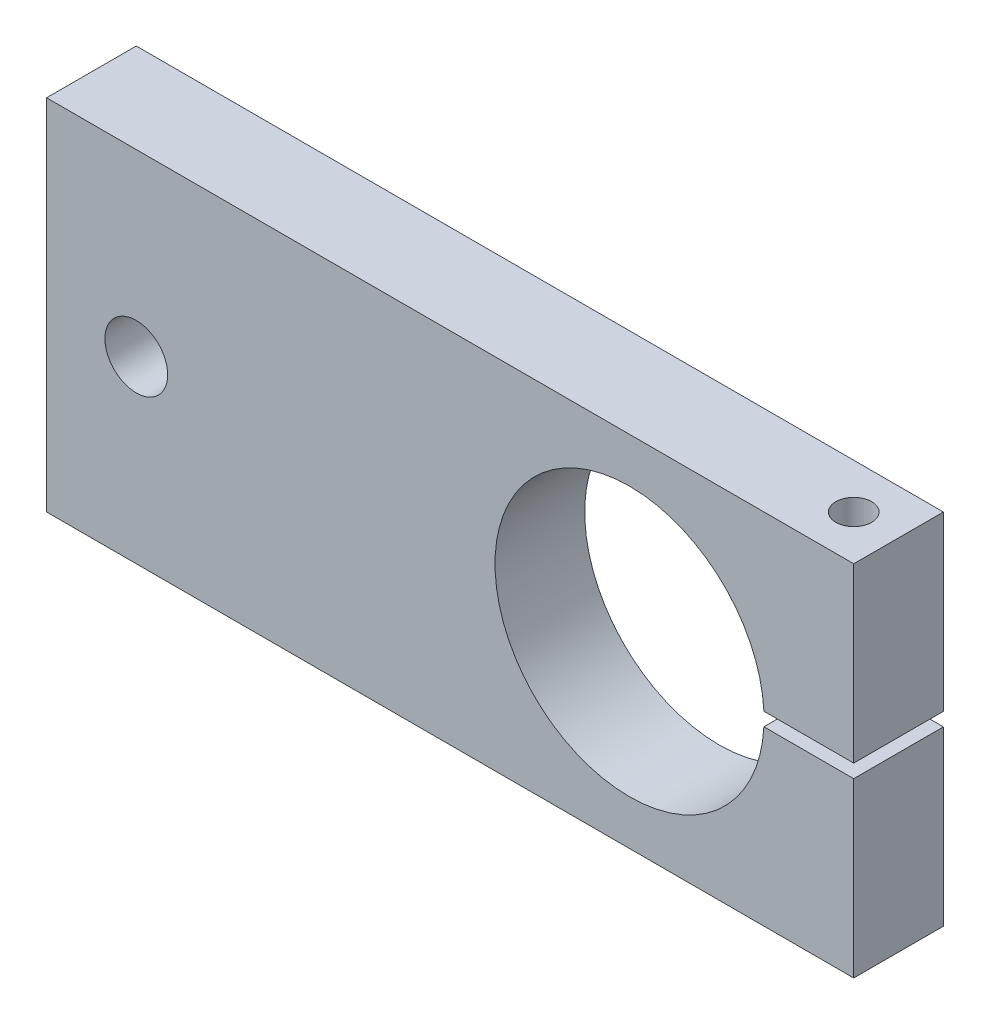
ISO-10303-21;
HEADER;
FILE_DESCRIPTION(('STEP AP214'),'2;1');
FILE_NAME('part.step','',(''),(''),'','','');
FILE_SCHEMA(('AUTOMOTIVE_DESIGN { 1 0 10303 214 1 1 1 1 }'));
ENDSEC;
DATA;
#1=APPLICATION_CONTEXT('core data for automotive mechanical design processes');
#2=APPLICATION_PROTOCOL_DEFINITION('international standard','automotive_design',2000,#1);
#3=PRODUCT_CONTEXT('',#1,'mechanical');
#4=PRODUCT('Part','Part','',(#3));
#5=PRODUCT_RELATED_PRODUCT_CATEGORY('part','',(#4));
#6=PRODUCT_DEFINITION_FORMATION('','',#4);
#7=PRODUCT_DEFINITION_CONTEXT('part definition',#1,'design');
#8=PRODUCT_DEFINITION('design','',#6,#7);
#9=PRODUCT_DEFINITION_SHAPE('','',#8);
#10=(LENGTH_UNIT() NAMED_UNIT(*) SI_UNIT(.MILLI.,.METRE.));
#11=(NAMED_UNIT(*) PLANE_ANGLE_UNIT() SI_UNIT($,.RADIAN.));
#12=(NAMED_UNIT(*) SI_UNIT($,.STERADIAN.) SOLID_ANGLE_UNIT());
#13=UNCERTAINTY_MEASURE_WITH_UNIT(LENGTH_MEASURE(1.E-05),#10,'distance_accuracy_value','');
#14=(GEOMETRIC_REPRESENTATION_CONTEXT(3) GLOBAL_UNCERTAINTY_ASSIGNED_CONTEXT((#13)) GLOBAL_UNIT_ASSIGNED_CONTEXT((#10,
#11,#12)) REPRESENTATION_CONTEXT('',''));
#15=CARTESIAN_POINT('',(0.,0.,0.));
#16=DIRECTION('',(0.,0.,1.));
#17=DIRECTION('',(1.,0.,0.));
#18=AXIS2_PLACEMENT_3D('',#15,#16,#17);
#19=CARTESIAN_POINT('',(50.,-40.,20.));
#20=DIRECTION('',(-1.,0.,0.));
#21=DIRECTION('',(0.,0.,1.));
#22=AXIS2_PLACEMENT_3D('',#19,#20,#21);
#23=PLANE('',#22);
#24=DIRECTION('',(0.,1.,0.));
#25=VECTOR('',#24,1.);
#26=CARTESIAN_POINT('',(50.,-40.,0.));
#27=LINE('',#26,#25);
#28=CARTESIAN_POINT('',(50.,-40.,0.));
#29=VERTEX_POINT('',#28);
#30=CARTESIAN_POINT('',(50.,-1.5,0.));
#31=VERTEX_POINT('',#30);
#32=EDGE_CURVE('E147',#29,#31,#27,.T.);
#33=ORIENTED_EDGE('',*,*,#32,.T.);
#34=DIRECTION('',(0.,0.,1.));
#35=VECTOR('',#34,1.);
#36=CARTESIAN_POINT('',(50.,-1.5,20.));
#37=LINE('',#36,#35);
#38=CARTESIAN_POINT('',(50.,-1.5,20.));
#39=VERTEX_POINT('',#38);
#40=EDGE_CURVE('E174',#31,#39,#37,.T.);
#41=ORIENTED_EDGE('',*,*,#40,.T.);
#42=DIRECTION('',(0.,1.,0.));
#43=VECTOR('',#42,1.);
#44=CARTESIAN_POINT('',(50.,-40.,20.));
#45=LINE('',#44,#43);
#46=CARTESIAN_POINT('',(50.,-40.,20.));
#47=VERTEX_POINT('',#46);
#48=EDGE_CURVE('E137',#47,#39,#45,.T.);
#49=ORIENTED_EDGE('',*,*,#48,.F.);
#50=DIRECTION('',(0.,0.,-1.));
#51=VECTOR('',#50,1.);
#52=CARTESIAN_POINT('',(50.,-40.,20.));
#53=LINE('',#52,#51);
#54=EDGE_CURVE('E11',#47,#29,#53,.T.);
#55=ORIENTED_EDGE('',*,*,#54,.T.);
#56=EDGE_LOOP('',(#33,#41,#49,#55));
#57=FACE_BOUND('',#56,.T.);
#58=ADVANCED_FACE('F36',(#57),#23,.F.);
#59=CARTESIAN_POINT('',(0.,0.,20.));
#60=DIRECTION('',(0.,0.,1.));
#61=DIRECTION('',(1.,0.,0.));
#62=AXIS2_PLACEMENT_3D('',#59,#60,#61);
#63=PLANE('',#62);
#64=DIRECTION('',(1.,0.,0.));
#65=VECTOR('',#64,1.);
#66=CARTESIAN_POINT('',(29.9624765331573,-1.5,20.));
#67=LINE('',#66,#65);
#68=CARTESIAN_POINT('',(29.9624765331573,-1.5,20.));
#69=VERTEX_POINT('',#68);
#70=EDGE_CURVE('E119',#69,#39,#67,.T.);
#71=ORIENTED_EDGE('',*,*,#70,.F.);
#72=CARTESIAN_POINT('',(0.,0.,20.));
#73=DIRECTION('',(0.,0.,1.));
#74=DIRECTION('',(1.,0.,0.));
#75=AXIS2_PLACEMENT_3D('',#72,#73,#74);
#76=CIRCLE('',#75,30.);
#77=CARTESIAN_POINT('',(29.9624765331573,1.5,20.));
#78=VERTEX_POINT('',#77);
#79=EDGE_CURVE('E122',#78,#69,#76,.T.);
#80=ORIENTED_EDGE('',*,*,#79,.F.);
#81=DIRECTION('',(-1.,0.,0.));
#82=VECTOR('',#81,1.);
#83=CARTESIAN_POINT('',(29.9624765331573,1.5,20.));
#84=LINE('',#83,#82);
#85=CARTESIAN_POINT('',(50.,1.5,20.));
#86=VERTEX_POINT('',#85);
#87=EDGE_CURVE('E61',#86,#78,#84,.T.);
#88=ORIENTED_EDGE('',*,*,#87,.F.);
#89=CARTESIAN_POINT('',(50.,40.,20.));
#90=VERTEX_POINT('',#89);
#91=EDGE_CURVE('E135',#86,#90,#45,.T.);
#92=ORIENTED_EDGE('',*,*,#91,.T.);
#93=DIRECTION('',(-1.,0.,0.));
#94=VECTOR('',#93,1.);
#95=CARTESIAN_POINT('',(50.,40.,20.));
#96=LINE('',#95,#94);
#97=CARTESIAN_POINT('',(-130.,40.,20.));
#98=VERTEX_POINT('',#97);
#99=EDGE_CURVE('E140',#90,#98,#96,.T.);
#100=ORIENTED_EDGE('',*,*,#99,.T.);
#101=DIRECTION('',(0.,-1.,0.));
#102=VECTOR('',#101,1.);
#103=CARTESIAN_POINT('',(-130.,40.,20.));
#104=LINE('',#103,#102);
#105=CARTESIAN_POINT('',(-130.,-40.,20.));
#106=VERTEX_POINT('',#105);
#107=EDGE_CURVE('E142',#98,#106,#104,.T.);
#108=ORIENTED_EDGE('',*,*,#107,.T.);
#109=DIRECTION('',(1.,0.,0.));
#110=VECTOR('',#109,1.);
#111=CARTESIAN_POINT('',(-130.,-40.,20.));
#112=LINE('',#111,#110);
#113=EDGE_CURVE('E132',#106,#47,#112,.T.);
#114=ORIENTED_EDGE('',*,*,#113,.T.);
#115=ORIENTED_EDGE('',*,*,#48,.T.);
#116=EDGE_LOOP('',(#71,#80,#88,#92,#100,#108,#114,#115));
#117=FACE_BOUND('',#116,.T.);
#118=CARTESIAN_POINT('',(-110.,0.,20.));
#119=DIRECTION('',(0.,0.,1.));
#120=DIRECTION('',(1.,0.,0.));
#121=AXIS2_PLACEMENT_3D('',#118,#119,#120);
#122=CIRCLE('',#121,7.);
#123=CARTESIAN_POINT('',(-103.,0.,20.));
#124=VERTEX_POINT('',#123);
#125=EDGE_CURVE('E123',#124,#124,#122,.T.);
#126=ORIENTED_EDGE('',*,*,#125,.F.);
#127=EDGE_LOOP('',(#126));
#128=FACE_BOUND('',#127,.T.);
#129=ADVANCED_FACE('F203',(#117,#128),#63,.T.);
#130=CARTESIAN_POINT('',(0.,0.,0.));
#131=DIRECTION('',(0.,0.,1.));
#132=DIRECTION('',(1.,0.,0.));
#133=AXIS2_PLACEMENT_3D('',#130,#131,#132);
#134=PLANE('',#133);
#135=CARTESIAN_POINT('',(0.,0.,0.));
#136=DIRECTION('',(0.,0.,1.));
#137=DIRECTION('',(1.,0.,0.));
#138=AXIS2_PLACEMENT_3D('',#135,#136,#137);
#139=CIRCLE('',#138,30.);
#140=CARTESIAN_POINT('',(29.9624765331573,1.50000000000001,0.));
#141=VERTEX_POINT('',#140);
#142=CARTESIAN_POINT('',(29.9624765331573,-1.5,0.));
#143=VERTEX_POINT('',#142);
#144=EDGE_CURVE('E116',#141,#143,#139,.T.);
#145=ORIENTED_EDGE('',*,*,#144,.T.);
#146=DIRECTION('',(1.,0.,0.));
#147=VECTOR('',#146,1.);
#148=CARTESIAN_POINT('',(29.9624765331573,-1.5,0.));
#149=LINE('',#148,#147);
#150=EDGE_CURVE('E53',#143,#31,#149,.T.);
#151=ORIENTED_EDGE('',*,*,#150,.T.);
#152=ORIENTED_EDGE('',*,*,#32,.F.);
#153=DIRECTION('',(1.,0.,0.));
#154=VECTOR('',#153,1.);
#155=CARTESIAN_POINT('',(-130.,-40.,0.));
#156=LINE('',#155,#154);
#157=CARTESIAN_POINT('',(-130.,-40.,0.));
#158=VERTEX_POINT('',#157);
#159=EDGE_CURVE('E125',#158,#29,#156,.T.);
#160=ORIENTED_EDGE('',*,*,#159,.F.);
#161=DIRECTION('',(0.,-1.,0.));
#162=VECTOR('',#161,1.);
#163=CARTESIAN_POINT('',(-130.,40.,0.));
#164=LINE('',#163,#162);
#165=CARTESIAN_POINT('',(-130.,40.,0.));
#166=VERTEX_POINT('',#165);
#167=EDGE_CURVE('E136',#166,#158,#164,.T.);
#168=ORIENTED_EDGE('',*,*,#167,.F.);
#169=DIRECTION('',(-1.,0.,0.));
#170=VECTOR('',#169,1.);
#171=CARTESIAN_POINT('',(50.,40.,0.));
#172=LINE('',#171,#170);
#173=CARTESIAN_POINT('',(50.,40.,0.));
#174=VERTEX_POINT('',#173);
#175=EDGE_CURVE('E150',#174,#166,#172,.T.);
#176=ORIENTED_EDGE('',*,*,#175,.F.);
#177=CARTESIAN_POINT('',(50.,1.5,0.));
#178=VERTEX_POINT('',#177);
#179=EDGE_CURVE('E118',#178,#174,#27,.T.);
#180=ORIENTED_EDGE('',*,*,#179,.F.);
#181=DIRECTION('',(-1.,0.,0.));
#182=VECTOR('',#181,1.);
#183=CARTESIAN_POINT('',(29.9624765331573,1.5,0.));
#184=LINE('',#183,#182);
#185=EDGE_CURVE('E103',#178,#141,#184,.T.);
#186=ORIENTED_EDGE('',*,*,#185,.T.);
#187=EDGE_LOOP('',(#145,#151,#152,#160,#168,#176,#180,#186));
#188=FACE_BOUND('',#187,.T.);
#189=CARTESIAN_POINT('',(-110.,0.,0.));
#190=DIRECTION('',(0.,0.,1.));
#191=DIRECTION('',(1.,0.,0.));
#192=AXIS2_PLACEMENT_3D('',#189,#190,#191);
#193=CIRCLE('',#192,7.);
#194=CARTESIAN_POINT('',(-103.,0.,0.));
#195=VERTEX_POINT('',#194);
#196=EDGE_CURVE('E128',#195,#195,#193,.T.);
#197=ORIENTED_EDGE('',*,*,#196,.T.);
#198=EDGE_LOOP('',(#197));
#199=FACE_BOUND('',#198,.T.);
#200=ADVANCED_FACE('F114',(#188,#199),#134,.F.);
#201=CARTESIAN_POINT('',(-130.,-40.,20.));
#202=DIRECTION('',(0.,1.,0.));
#203=DIRECTION('',(0.,0.,1.));
#204=AXIS2_PLACEMENT_3D('',#201,#202,#203);
#205=PLANE('',#204);
#206=CARTESIAN_POINT('',(40.,-40.,10.));
#207=DIRECTION('',(0.,-1.,0.));
#208=DIRECTION('',(0.,0.,-1.));
#209=AXIS2_PLACEMENT_3D('',#206,#207,#208);
#210=CIRCLE('',#209,7.);
#211=CARTESIAN_POINT('',(40.,-40.,3.));
#212=VERTEX_POINT('',#211);
#213=EDGE_CURVE('E180',#212,#212,#210,.T.);
#214=ORIENTED_EDGE('',*,*,#213,.F.);
#215=EDGE_LOOP('',(#214));
#216=FACE_BOUND('',#215,.T.);
#217=ORIENTED_EDGE('',*,*,#159,.T.);
#218=ORIENTED_EDGE('',*,*,#54,.F.);
#219=ORIENTED_EDGE('',*,*,#113,.F.);
#220=DIRECTION('',(0.,0.,-1.));
#221=VECTOR('',#220,1.);
#222=CARTESIAN_POINT('',(-130.,-40.,20.));
#223=LINE('',#222,#221);
#224=EDGE_CURVE('E144',#106,#158,#223,.T.);
#225=ORIENTED_EDGE('',*,*,#224,.T.);
#226=EDGE_LOOP('',(#217,#218,#219,#225));
#227=FACE_BOUND('',#226,.T.);
#228=ADVANCED_FACE('F38',(#216,#227),#205,.F.);
#229=ORIENTED_EDGE('',*,*,#91,.F.);
#230=DIRECTION('',(0.,0.,-1.));
#231=VECTOR('',#230,1.);
#232=CARTESIAN_POINT('',(50.,1.49999999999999,20.));
#233=LINE('',#232,#231);
#234=EDGE_CURVE('E165',#86,#178,#233,.T.);
#235=ORIENTED_EDGE('',*,*,#234,.T.);
#236=ORIENTED_EDGE('',*,*,#179,.T.);
#237=DIRECTION('',(0.,0.,-1.));
#238=VECTOR('',#237,1.);
#239=CARTESIAN_POINT('',(50.,40.,20.));
#240=LINE('',#239,#238);
#241=EDGE_CURVE('E45',#90,#174,#240,.T.);
#242=ORIENTED_EDGE('',*,*,#241,.F.);
#243=EDGE_LOOP('',(#229,#235,#236,#242));
#244=FACE_BOUND('',#243,.T.);
#245=ADVANCED_FACE('F205',(#244),#23,.F.);
#246=CARTESIAN_POINT('',(50.,40.,20.));
#247=DIRECTION('',(0.,-1.,0.));
#248=DIRECTION('',(1.,0.,0.));
#249=AXIS2_PLACEMENT_3D('',#246,#247,#248);
#250=PLANE('',#249);
#251=CARTESIAN_POINT('',(40.,40.,10.));
#252=DIRECTION('',(0.,1.,0.));
#253=DIRECTION('',(-1.,0.,0.));
#254=AXIS2_PLACEMENT_3D('',#251,#252,#253);
#255=CIRCLE('',#254,4.00000000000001);
#256=CARTESIAN_POINT('',(36.,40.,10.));
#257=VERTEX_POINT('',#256);
#258=EDGE_CURVE('E177',#257,#257,#255,.T.);
#259=ORIENTED_EDGE('',*,*,#258,.F.);
#260=EDGE_LOOP('',(#259));
#261=FACE_BOUND('',#260,.T.);
#262=ORIENTED_EDGE('',*,*,#175,.T.);
#263=DIRECTION('',(0.,0.,-1.));
#264=VECTOR('',#263,1.);
#265=CARTESIAN_POINT('',(-130.,40.,20.));
#266=LINE('',#265,#264);
#267=EDGE_CURVE('E155',#98,#166,#266,.T.);
#268=ORIENTED_EDGE('',*,*,#267,.F.);
#269=ORIENTED_EDGE('',*,*,#99,.F.);
#270=ORIENTED_EDGE('',*,*,#241,.T.);
#271=EDGE_LOOP('',(#262,#268,#269,#270));
#272=FACE_BOUND('',#271,.T.);
#273=ADVANCED_FACE('F213',(#261,#272),#250,.F.);
#274=CARTESIAN_POINT('',(-130.,40.,20.));
#275=DIRECTION('',(1.,0.,0.));
#276=DIRECTION('',(0.,1.,0.));
#277=AXIS2_PLACEMENT_3D('',#274,#275,#276);
#278=PLANE('',#277);
#279=ORIENTED_EDGE('',*,*,#167,.T.);
#280=ORIENTED_EDGE('',*,*,#224,.F.);
#281=ORIENTED_EDGE('',*,*,#107,.F.);
#282=ORIENTED_EDGE('',*,*,#267,.T.);
#283=EDGE_LOOP('',(#279,#280,#281,#282));
#284=FACE_BOUND('',#283,.T.);
#285=ADVANCED_FACE('F199',(#284),#278,.F.);
#286=CARTESIAN_POINT('',(0.,0.,20.));
#287=DIRECTION('',(0.,0.,-1.));
#288=DIRECTION('',(-1.,0.,0.));
#289=AXIS2_PLACEMENT_3D('',#286,#287,#288);
#290=CYLINDRICAL_SURFACE('',#289,30.);
#291=DIRECTION('',(0.,0.,1.));
#292=VECTOR('',#291,1.);
#293=CARTESIAN_POINT('',(29.9624765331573,-1.5,0.));
#294=LINE('',#293,#292);
#295=EDGE_CURVE('E109',#143,#69,#294,.T.);
#296=ORIENTED_EDGE('',*,*,#295,.F.);
#297=ORIENTED_EDGE('',*,*,#144,.F.);
#298=DIRECTION('',(0.,0.,1.));
#299=VECTOR('',#298,1.);
#300=CARTESIAN_POINT('',(29.9624765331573,1.50000000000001,0.));
#301=LINE('',#300,#299);
#302=EDGE_CURVE('E100',#141,#78,#301,.T.);
#303=ORIENTED_EDGE('',*,*,#302,.T.);
#304=ORIENTED_EDGE('',*,*,#79,.T.);
#305=EDGE_LOOP('',(#296,#297,#303,#304));
#306=FACE_BOUND('',#305,.T.);
#307=ADVANCED_FACE('F121',(#306),#290,.F.);
#308=CARTESIAN_POINT('',(-110.,0.,20.));
#309=DIRECTION('',(0.,0.,-1.));
#310=DIRECTION('',(-1.,0.,0.));
#311=AXIS2_PLACEMENT_3D('',#308,#309,#310);
#312=CYLINDRICAL_SURFACE('',#311,7.);
#313=ORIENTED_EDGE('',*,*,#125,.T.);
#314=EDGE_LOOP('',(#313));
#315=FACE_BOUND('',#314,.T.);
#316=ORIENTED_EDGE('',*,*,#196,.F.);
#317=EDGE_LOOP('',(#316));
#318=FACE_BOUND('',#317,.T.);
#319=ADVANCED_FACE('F187',(#315,#318),#312,.F.);
#320=CARTESIAN_POINT('',(40.,-30.,10.));
#321=DIRECTION('',(0.,-1.,0.));
#322=DIRECTION('',(0.,0.,-1.));
#323=AXIS2_PLACEMENT_3D('',#320,#321,#322);
#324=PLANE('',#323);
#325=CARTESIAN_POINT('',(40.,-30.,10.));
#326=DIRECTION('',(0.,-1.,0.));
#327=DIRECTION('',(0.,0.,-1.));
#328=AXIS2_PLACEMENT_3D('',#325,#326,#327);
#329=CIRCLE('',#328,7.);
#330=CARTESIAN_POINT('',(40.,-30.,3.));
#331=VERTEX_POINT('',#330);
#332=EDGE_CURVE('E162',#331,#331,#329,.T.);
#333=ORIENTED_EDGE('',*,*,#332,.T.);
#334=EDGE_LOOP('',(#333));
#335=FACE_BOUND('',#334,.T.);
#336=CARTESIAN_POINT('',(40.,-30.,10.));
#337=DIRECTION('',(0.,-1.,0.));
#338=DIRECTION('',(0.,0.,-1.));
#339=AXIS2_PLACEMENT_3D('',#336,#337,#338);
#340=CIRCLE('',#339,4.5);
#341=CARTESIAN_POINT('',(40.,-30.,5.5));
#342=VERTEX_POINT('',#341);
#343=EDGE_CURVE('E160',#342,#342,#340,.F.);
#344=ORIENTED_EDGE('',*,*,#343,.T.);
#345=EDGE_LOOP('',(#344));
#346=FACE_BOUND('',#345,.T.);
#347=ADVANCED_FACE('F189',(#335,#346),#324,.T.);
#348=CARTESIAN_POINT('',(40.,-30.,10.));
#349=DIRECTION('',(0.,-1.,0.));
#350=DIRECTION('',(0.,0.,-1.));
#351=AXIS2_PLACEMENT_3D('',#348,#349,#350);
#352=CYLINDRICAL_SURFACE('',#351,7.);
#353=ORIENTED_EDGE('',*,*,#332,.F.);
#354=EDGE_LOOP('',(#353));
#355=FACE_BOUND('',#354,.T.);
#356=ORIENTED_EDGE('',*,*,#213,.T.);
#357=EDGE_LOOP('',(#356));
#358=FACE_BOUND('',#357,.T.);
#359=ADVANCED_FACE('F196',(#355,#358),#352,.F.);
#360=CARTESIAN_POINT('',(40.,0.,10.));
#361=DIRECTION('',(0.,-1.,0.));
#362=DIRECTION('',(0.,0.,-1.));
#363=AXIS2_PLACEMENT_3D('',#360,#361,#362);
#364=CYLINDRICAL_SURFACE('',#363,4.5);
#365=CARTESIAN_POINT('',(40.,-1.5,10.));
#366=DIRECTION('',(0.,-1.,0.));
#367=DIRECTION('',(0.,0.,-1.));
#368=AXIS2_PLACEMENT_3D('',#365,#366,#367);
#369=CIRCLE('',#368,4.5);
#370=CARTESIAN_POINT('',(40.,-1.5,5.5));
#371=VERTEX_POINT('',#370);
#372=EDGE_CURVE('E40',#371,#371,#369,.F.);
#373=ORIENTED_EDGE('',*,*,#372,.T.);
#374=EDGE_LOOP('',(#373));
#375=FACE_BOUND('',#374,.T.);
#376=ORIENTED_EDGE('',*,*,#343,.F.);
#377=EDGE_LOOP('',(#376));
#378=FACE_BOUND('',#377,.T.);
#379=ADVANCED_FACE('F249',(#375,#378),#364,.F.);
#380=CARTESIAN_POINT('',(40.,0.,10.));
#381=DIRECTION('',(0.,1.,0.));
#382=DIRECTION('',(-1.,0.,0.));
#383=AXIS2_PLACEMENT_3D('',#380,#381,#382);
#384=CYLINDRICAL_SURFACE('',#383,4.00000000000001);
#385=CARTESIAN_POINT('',(40.,1.5,10.));
#386=DIRECTION('',(0.,1.,0.));
#387=DIRECTION('',(0.,0.,1.));
#388=AXIS2_PLACEMENT_3D('',#385,#386,#387);
#389=CIRCLE('',#388,4.00000000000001);
#390=CARTESIAN_POINT('',(40.,1.5,14.));
#391=VERTEX_POINT('',#390);
#392=EDGE_CURVE('E163',#391,#391,#389,.F.);
#393=ORIENTED_EDGE('',*,*,#392,.T.);
#394=EDGE_LOOP('',(#393));
#395=FACE_BOUND('',#394,.T.);
#396=ORIENTED_EDGE('',*,*,#258,.T.);
#397=EDGE_LOOP('',(#396));
#398=FACE_BOUND('',#397,.T.);
#399=ADVANCED_FACE('F243',(#395,#398),#384,.F.);
#400=CARTESIAN_POINT('',(29.9624765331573,1.5,0.));
#401=DIRECTION('',(0.,1.,0.));
#402=DIRECTION('',(0.,0.,1.));
#403=AXIS2_PLACEMENT_3D('',#400,#401,#402);
#404=PLANE('',#403);
#405=ORIENTED_EDGE('',*,*,#392,.F.);
#406=EDGE_LOOP('',(#405));
#407=FACE_BOUND('',#406,.T.);
#408=ORIENTED_EDGE('',*,*,#87,.T.);
#409=ORIENTED_EDGE('',*,*,#302,.F.);
#410=ORIENTED_EDGE('',*,*,#185,.F.);
#411=ORIENTED_EDGE('',*,*,#234,.F.);
#412=EDGE_LOOP('',(#408,#409,#410,#411));
#413=FACE_BOUND('',#412,.T.);
#414=ADVANCED_FACE('F102',(#407,#413),#404,.F.);
#415=CARTESIAN_POINT('',(29.9624765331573,-1.5,0.));
#416=DIRECTION('',(0.,-1.,0.));
#417=DIRECTION('',(0.,0.,-1.));
#418=AXIS2_PLACEMENT_3D('',#415,#416,#417);
#419=PLANE('',#418);
#420=ORIENTED_EDGE('',*,*,#372,.F.);
#421=EDGE_LOOP('',(#420));
#422=FACE_BOUND('',#421,.T.);
#423=ORIENTED_EDGE('',*,*,#150,.F.);
#424=ORIENTED_EDGE('',*,*,#295,.T.);
#425=ORIENTED_EDGE('',*,*,#70,.T.);
#426=ORIENTED_EDGE('',*,*,#40,.F.);
#427=EDGE_LOOP('',(#423,#424,#425,#426));
#428=FACE_BOUND('',#427,.T.);
#429=ADVANCED_FACE('F236',(#422,#428),#419,.F.);
#430=CLOSED_SHELL('',(#58,#129,#200,#228,#245,#273,#285,#307,#319,#347,#359,#379,#399,#414,#429));
#431=MANIFOLD_SOLID_BREP('B2',#430);
#432=ADVANCED_BREP_SHAPE_REPRESENTATION('',(#18,#431),#14);
#433=SHAPE_DEFINITION_REPRESENTATION(#9,#432);
ENDSEC;
END-ISO-10303-21;
